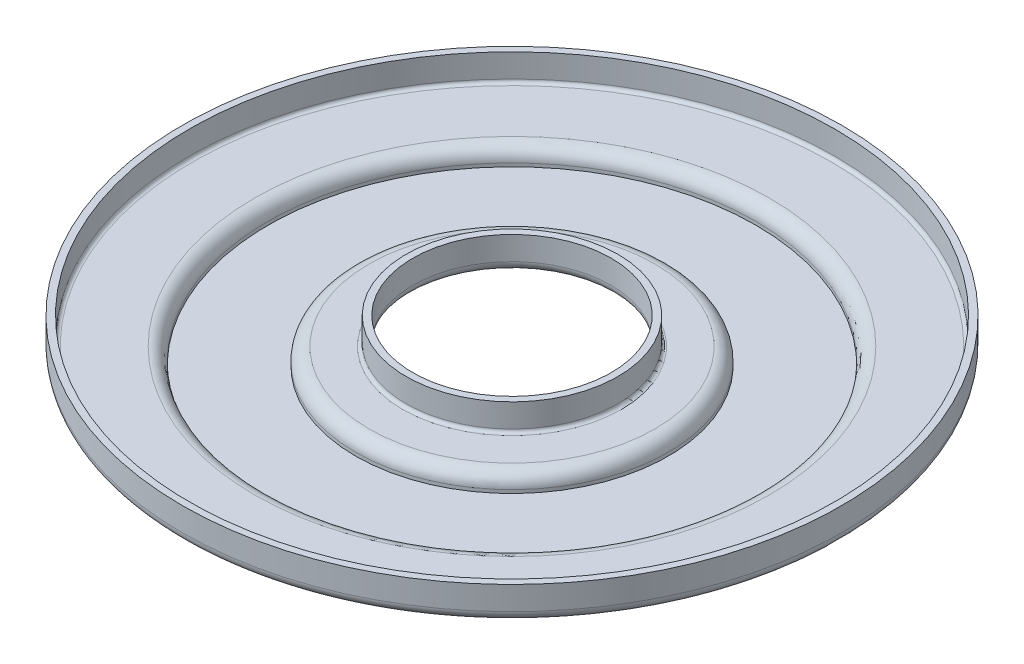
ISO-10303-21;
HEADER;
FILE_DESCRIPTION(('STEP AP214'),'2;1');
FILE_NAME('part.step','',(''),(''),'','','');
FILE_SCHEMA(('AUTOMOTIVE_DESIGN { 1 0 10303 214 1 1 1 1 }'));
ENDSEC;
DATA;
#1=APPLICATION_CONTEXT('core data for automotive mechanical design processes');
#2=APPLICATION_PROTOCOL_DEFINITION('international standard','automotive_design',2000,#1);
#3=PRODUCT_CONTEXT('',#1,'mechanical');
#4=PRODUCT('Part','Part','',(#3));
#5=PRODUCT_RELATED_PRODUCT_CATEGORY('part','',(#4));
#6=PRODUCT_DEFINITION_FORMATION('','',#4);
#7=PRODUCT_DEFINITION_CONTEXT('part definition',#1,'design');
#8=PRODUCT_DEFINITION('design','',#6,#7);
#9=PRODUCT_DEFINITION_SHAPE('','',#8);
#10=(LENGTH_UNIT() NAMED_UNIT(*) SI_UNIT(.MILLI.,.METRE.));
#11=(NAMED_UNIT(*) PLANE_ANGLE_UNIT() SI_UNIT($,.RADIAN.));
#12=(NAMED_UNIT(*) SI_UNIT($,.STERADIAN.) SOLID_ANGLE_UNIT());
#13=UNCERTAINTY_MEASURE_WITH_UNIT(LENGTH_MEASURE(1.E-05),#10,'distance_accuracy_value','');
#14=(GEOMETRIC_REPRESENTATION_CONTEXT(3) GLOBAL_UNCERTAINTY_ASSIGNED_CONTEXT((#13)) GLOBAL_UNIT_ASSIGNED_CONTEXT((#10,
#11,#12)) REPRESENTATION_CONTEXT('',''));
#15=CARTESIAN_POINT('',(0.,0.,0.));
#16=DIRECTION('',(0.,0.,1.));
#17=DIRECTION('',(1.,0.,0.));
#18=AXIS2_PLACEMENT_3D('',#15,#16,#17);
#19=CARTESIAN_POINT('',(0.,0.,0.));
#20=DIRECTION('',(0.,-1.,0.));
#21=DIRECTION('',(0.,0.,-1.));
#22=AXIS2_PLACEMENT_3D('',#19,#20,#21);
#23=CYLINDRICAL_SURFACE('',#22,98.);
#24=CARTESIAN_POINT('',(0.,15.,0.));
#25=DIRECTION('',(0.,-1.,0.));
#26=DIRECTION('',(0.,0.,-1.));
#27=AXIS2_PLACEMENT_3D('',#24,#25,#26);
#28=CIRCLE('',#27,98.);
#29=CARTESIAN_POINT('',(0.,15.,-98.));
#30=VERTEX_POINT('',#29);
#31=EDGE_CURVE('E10',#30,#30,#28,.T.);
#32=ORIENTED_EDGE('',*,*,#31,.T.);
#33=EDGE_LOOP('',(#32));
#34=FACE_BOUND('',#33,.T.);
#35=CARTESIAN_POINT('',(0.,8.00000000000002,0.));
#36=DIRECTION('',(0.,-1.,0.));
#37=DIRECTION('',(0.,0.,-1.));
#38=AXIS2_PLACEMENT_3D('',#35,#36,#37);
#39=CIRCLE('',#38,98.);
#40=CARTESIAN_POINT('',(0.,8.00000000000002,-98.));
#41=VERTEX_POINT('',#40);
#42=EDGE_CURVE('E117',#41,#41,#39,.T.);
#43=ORIENTED_EDGE('',*,*,#42,.F.);
#44=EDGE_LOOP('',(#43));
#45=FACE_BOUND('',#44,.T.);
#46=ADVANCED_FACE('F35',(#34,#45),#23,.T.);
#47=CARTESIAN_POINT('',(96.,15.,0.));
#48=DIRECTION('',(0.,-1.,0.));
#49=DIRECTION('',(0.,0.,-1.));
#50=AXIS2_PLACEMENT_3D('',#47,#48,#49);
#51=PLANE('',#50);
#52=ORIENTED_EDGE('',*,*,#31,.F.);
#53=EDGE_LOOP('',(#52));
#54=FACE_BOUND('',#53,.T.);
#55=CARTESIAN_POINT('',(0.,15.,0.));
#56=DIRECTION('',(0.,-1.,0.));
#57=DIRECTION('',(0.,0.,-1.));
#58=AXIS2_PLACEMENT_3D('',#55,#56,#57);
#59=CIRCLE('',#58,96.);
#60=CARTESIAN_POINT('',(0.,15.,-96.));
#61=VERTEX_POINT('',#60);
#62=EDGE_CURVE('E41',#61,#61,#59,.T.);
#63=ORIENTED_EDGE('',*,*,#62,.T.);
#64=EDGE_LOOP('',(#63));
#65=FACE_BOUND('',#64,.T.);
#66=ADVANCED_FACE('F125',(#54,#65),#51,.F.);
#67=CARTESIAN_POINT('',(0.,0.,0.));
#68=DIRECTION('',(0.,-1.,0.));
#69=DIRECTION('',(0.,0.,-1.));
#70=AXIS2_PLACEMENT_3D('',#67,#68,#69);
#71=CYLINDRICAL_SURFACE('',#70,96.);
#72=ORIENTED_EDGE('',*,*,#62,.F.);
#73=EDGE_LOOP('',(#72));
#74=FACE_BOUND('',#73,.T.);
#75=CARTESIAN_POINT('',(0.,8.00000000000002,0.));
#76=DIRECTION('',(0.,-1.,0.));
#77=DIRECTION('',(0.,0.,-1.));
#78=AXIS2_PLACEMENT_3D('',#75,#76,#77);
#79=CIRCLE('',#78,96.);
#80=CARTESIAN_POINT('',(0.,8.00000000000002,-96.));
#81=VERTEX_POINT('',#80);
#82=EDGE_CURVE('E45',#81,#81,#79,.T.);
#83=ORIENTED_EDGE('',*,*,#82,.T.);
#84=EDGE_LOOP('',(#83));
#85=FACE_BOUND('',#84,.T.);
#86=ADVANCED_FACE('F129',(#74,#85),#71,.F.);
#87=CARTESIAN_POINT('',(0.,8.,0.));
#88=DIRECTION('',(0.,-1.,0.));
#89=DIRECTION('',(0.,0.,-1.));
#90=AXIS2_PLACEMENT_3D('',#87,#88,#89);
#91=TOROIDAL_SURFACE('',#90,95.,1.);
#92=ORIENTED_EDGE('',*,*,#82,.F.);
#93=EDGE_LOOP('',(#92));
#94=FACE_BOUND('',#93,.T.);
#95=CARTESIAN_POINT('',(0.,7.,0.));
#96=DIRECTION('',(0.,-1.,0.));
#97=DIRECTION('',(0.,0.,-1.));
#98=AXIS2_PLACEMENT_3D('',#95,#96,#97);
#99=CIRCLE('',#98,95.);
#100=CARTESIAN_POINT('',(0.,7.,-95.));
#101=VERTEX_POINT('',#100);
#102=EDGE_CURVE('E49',#101,#101,#99,.T.);
#103=ORIENTED_EDGE('',*,*,#102,.T.);
#104=EDGE_LOOP('',(#103));
#105=FACE_BOUND('',#104,.T.);
#106=ADVANCED_FACE('F134',(#94,#105),#91,.F.);
#107=CARTESIAN_POINT('',(95.,7.,0.));
#108=DIRECTION('',(0.,-1.,0.));
#109=DIRECTION('',(0.,0.,-1.));
#110=AXIS2_PLACEMENT_3D('',#107,#108,#109);
#111=PLANE('',#110);
#112=ORIENTED_EDGE('',*,*,#102,.F.);
#113=EDGE_LOOP('',(#112));
#114=FACE_BOUND('',#113,.T.);
#115=CARTESIAN_POINT('',(0.,7.,0.));
#116=DIRECTION('',(0.,-1.,0.));
#117=DIRECTION('',(0.,0.,-1.));
#118=AXIS2_PLACEMENT_3D('',#115,#116,#117);
#119=CIRCLE('',#118,76.5);
#120=CARTESIAN_POINT('',(0.,7.,-76.5));
#121=VERTEX_POINT('',#120);
#122=EDGE_CURVE('E54',#121,#121,#119,.T.);
#123=ORIENTED_EDGE('',*,*,#122,.T.);
#124=EDGE_LOOP('',(#123));
#125=FACE_BOUND('',#124,.T.);
#126=ADVANCED_FACE('F140',(#114,#125),#111,.F.);
#127=CARTESIAN_POINT('',(0.,3.,0.));
#128=DIRECTION('',(0.,-1.,0.));
#129=DIRECTION('',(0.,0.,-1.));
#130=AXIS2_PLACEMENT_3D('',#127,#128,#129);
#131=TOROIDAL_SURFACE('',#130,76.5,4.);
#132=ORIENTED_EDGE('',*,*,#122,.F.);
#133=EDGE_LOOP('',(#132));
#134=FACE_BOUND('',#133,.T.);
#135=CARTESIAN_POINT('',(0.,2.99999999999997,0.));
#136=DIRECTION('',(0.,-1.,0.));
#137=DIRECTION('',(0.,0.,-1.));
#138=AXIS2_PLACEMENT_3D('',#135,#136,#137);
#139=CIRCLE('',#138,72.5);
#140=CARTESIAN_POINT('',(0.,2.99999999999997,-72.5));
#141=VERTEX_POINT('',#140);
#142=EDGE_CURVE('E57',#141,#141,#139,.T.);
#143=ORIENTED_EDGE('',*,*,#142,.T.);
#144=EDGE_LOOP('',(#143));
#145=FACE_BOUND('',#144,.T.);
#146=ADVANCED_FACE('F144',(#134,#145),#131,.T.);
#147=CARTESIAN_POINT('',(0.,0.,0.));
#148=DIRECTION('',(0.,-1.,0.));
#149=DIRECTION('',(0.,0.,-1.));
#150=AXIS2_PLACEMENT_3D('',#147,#148,#149);
#151=CYLINDRICAL_SURFACE('',#150,72.5);
#152=ORIENTED_EDGE('',*,*,#142,.F.);
#153=EDGE_LOOP('',(#152));
#154=FACE_BOUND('',#153,.T.);
#155=CARTESIAN_POINT('',(0.,2.,0.));
#156=DIRECTION('',(0.,-1.,0.));
#157=DIRECTION('',(0.,0.,-1.));
#158=AXIS2_PLACEMENT_3D('',#155,#156,#157);
#159=CIRCLE('',#158,72.5);
#160=CARTESIAN_POINT('',(0.,2.,-72.5));
#161=VERTEX_POINT('',#160);
#162=EDGE_CURVE('E60',#161,#161,#159,.T.);
#163=ORIENTED_EDGE('',*,*,#162,.T.);
#164=EDGE_LOOP('',(#163));
#165=FACE_BOUND('',#164,.T.);
#166=ADVANCED_FACE('F148',(#154,#165),#151,.F.);
#167=CARTESIAN_POINT('',(46.5,2.,0.));
#168=DIRECTION('',(0.,-1.,0.));
#169=DIRECTION('',(0.,0.,-1.));
#170=AXIS2_PLACEMENT_3D('',#167,#168,#169);
#171=PLANE('',#170);
#172=ORIENTED_EDGE('',*,*,#162,.F.);
#173=EDGE_LOOP('',(#172));
#174=FACE_BOUND('',#173,.T.);
#175=CARTESIAN_POINT('',(0.,2.,0.));
#176=DIRECTION('',(0.,-1.,0.));
#177=DIRECTION('',(0.,0.,-1.));
#178=AXIS2_PLACEMENT_3D('',#175,#176,#177);
#179=CIRCLE('',#178,46.5);
#180=CARTESIAN_POINT('',(0.,2.,-46.5));
#181=VERTEX_POINT('',#180);
#182=EDGE_CURVE('E63',#181,#181,#179,.T.);
#183=ORIENTED_EDGE('',*,*,#182,.T.);
#184=EDGE_LOOP('',(#183));
#185=FACE_BOUND('',#184,.T.);
#186=ADVANCED_FACE('F152',(#174,#185),#171,.F.);
#187=CARTESIAN_POINT('',(0.,0.,0.));
#188=DIRECTION('',(0.,-1.,0.));
#189=DIRECTION('',(0.,0.,-1.));
#190=AXIS2_PLACEMENT_3D('',#187,#188,#189);
#191=CYLINDRICAL_SURFACE('',#190,46.5);
#192=ORIENTED_EDGE('',*,*,#182,.F.);
#193=EDGE_LOOP('',(#192));
#194=FACE_BOUND('',#193,.T.);
#195=CARTESIAN_POINT('',(0.,2.99999999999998,0.));
#196=DIRECTION('',(0.,-1.,0.));
#197=DIRECTION('',(0.,0.,-1.));
#198=AXIS2_PLACEMENT_3D('',#195,#196,#197);
#199=CIRCLE('',#198,46.5);
#200=CARTESIAN_POINT('',(0.,2.99999999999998,-46.5));
#201=VERTEX_POINT('',#200);
#202=EDGE_CURVE('E66',#201,#201,#199,.T.);
#203=ORIENTED_EDGE('',*,*,#202,.T.);
#204=EDGE_LOOP('',(#203));
#205=FACE_BOUND('',#204,.T.);
#206=ADVANCED_FACE('F156',(#194,#205),#191,.T.);
#207=CARTESIAN_POINT('',(0.,2.99999999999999,0.));
#208=DIRECTION('',(0.,-1.,0.));
#209=DIRECTION('',(0.,0.,-1.));
#210=AXIS2_PLACEMENT_3D('',#207,#208,#209);
#211=TOROIDAL_SURFACE('',#210,42.5,4.);
#212=ORIENTED_EDGE('',*,*,#202,.F.);
#213=EDGE_LOOP('',(#212));
#214=FACE_BOUND('',#213,.T.);
#215=CARTESIAN_POINT('',(0.,6.99999999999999,0.));
#216=DIRECTION('',(0.,-1.,0.));
#217=DIRECTION('',(0.,0.,-1.));
#218=AXIS2_PLACEMENT_3D('',#215,#216,#217);
#219=CIRCLE('',#218,42.5);
#220=CARTESIAN_POINT('',(0.,6.99999999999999,-42.5));
#221=VERTEX_POINT('',#220);
#222=EDGE_CURVE('E69',#221,#221,#219,.T.);
#223=ORIENTED_EDGE('',*,*,#222,.T.);
#224=EDGE_LOOP('',(#223));
#225=FACE_BOUND('',#224,.T.);
#226=ADVANCED_FACE('F160',(#214,#225),#211,.T.);
#227=CARTESIAN_POINT('',(42.5,6.99999999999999,0.));
#228=DIRECTION('',(0.,-1.,0.));
#229=DIRECTION('',(0.,0.,-1.));
#230=AXIS2_PLACEMENT_3D('',#227,#228,#229);
#231=PLANE('',#230);
#232=ORIENTED_EDGE('',*,*,#222,.F.);
#233=EDGE_LOOP('',(#232));
#234=FACE_BOUND('',#233,.T.);
#235=CARTESIAN_POINT('',(0.,6.99999999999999,0.));
#236=DIRECTION('',(0.,-1.,0.));
#237=DIRECTION('',(0.,0.,-1.));
#238=AXIS2_PLACEMENT_3D('',#235,#236,#237);
#239=CIRCLE('',#238,32.5);
#240=CARTESIAN_POINT('',(0.,6.99999999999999,-32.5));
#241=VERTEX_POINT('',#240);
#242=EDGE_CURVE('E72',#241,#241,#239,.T.);
#243=ORIENTED_EDGE('',*,*,#242,.T.);
#244=EDGE_LOOP('',(#243));
#245=FACE_BOUND('',#244,.T.);
#246=ADVANCED_FACE('F164',(#234,#245),#231,.F.);
#247=CARTESIAN_POINT('',(0.,7.99999999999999,0.));
#248=DIRECTION('',(0.,-1.,0.));
#249=DIRECTION('',(0.,0.,-1.));
#250=AXIS2_PLACEMENT_3D('',#247,#248,#249);
#251=TOROIDAL_SURFACE('',#250,32.5,0.999999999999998);
#252=ORIENTED_EDGE('',*,*,#242,.F.);
#253=EDGE_LOOP('',(#252));
#254=FACE_BOUND('',#253,.T.);
#255=CARTESIAN_POINT('',(0.,8.,0.));
#256=DIRECTION('',(0.,-1.,0.));
#257=DIRECTION('',(0.,0.,-1.));
#258=AXIS2_PLACEMENT_3D('',#255,#256,#257);
#259=CIRCLE('',#258,31.5);
#260=CARTESIAN_POINT('',(0.,8.,-31.5));
#261=VERTEX_POINT('',#260);
#262=EDGE_CURVE('E75',#261,#261,#259,.T.);
#263=ORIENTED_EDGE('',*,*,#262,.T.);
#264=EDGE_LOOP('',(#263));
#265=FACE_BOUND('',#264,.T.);
#266=ADVANCED_FACE('F168',(#254,#265),#251,.F.);
#267=CARTESIAN_POINT('',(0.,0.,0.));
#268=DIRECTION('',(0.,-1.,0.));
#269=DIRECTION('',(0.,0.,-1.));
#270=AXIS2_PLACEMENT_3D('',#267,#268,#269);
#271=CYLINDRICAL_SURFACE('',#270,31.5);
#272=ORIENTED_EDGE('',*,*,#262,.F.);
#273=EDGE_LOOP('',(#272));
#274=FACE_BOUND('',#273,.T.);
#275=CARTESIAN_POINT('',(0.,15.,0.));
#276=DIRECTION('',(0.,-1.,0.));
#277=DIRECTION('',(0.,0.,-1.));
#278=AXIS2_PLACEMENT_3D('',#275,#276,#277);
#279=CIRCLE('',#278,31.5);
#280=CARTESIAN_POINT('',(0.,15.,-31.5));
#281=VERTEX_POINT('',#280);
#282=EDGE_CURVE('E78',#281,#281,#279,.T.);
#283=ORIENTED_EDGE('',*,*,#282,.T.);
#284=EDGE_LOOP('',(#283));
#285=FACE_BOUND('',#284,.T.);
#286=ADVANCED_FACE('F172',(#274,#285),#271,.T.);
#287=CARTESIAN_POINT('',(29.5,15.,0.));
#288=DIRECTION('',(0.,-1.,0.));
#289=DIRECTION('',(0.,0.,-1.));
#290=AXIS2_PLACEMENT_3D('',#287,#288,#289);
#291=PLANE('',#290);
#292=ORIENTED_EDGE('',*,*,#282,.F.);
#293=EDGE_LOOP('',(#292));
#294=FACE_BOUND('',#293,.T.);
#295=CARTESIAN_POINT('',(0.,15.,0.));
#296=DIRECTION('',(0.,-1.,0.));
#297=DIRECTION('',(0.,0.,-1.));
#298=AXIS2_PLACEMENT_3D('',#295,#296,#297);
#299=CIRCLE('',#298,29.5);
#300=CARTESIAN_POINT('',(0.,15.,-29.5));
#301=VERTEX_POINT('',#300);
#302=EDGE_CURVE('E81',#301,#301,#299,.T.);
#303=ORIENTED_EDGE('',*,*,#302,.T.);
#304=EDGE_LOOP('',(#303));
#305=FACE_BOUND('',#304,.T.);
#306=ADVANCED_FACE('F176',(#294,#305),#291,.F.);
#307=CARTESIAN_POINT('',(0.,0.,0.));
#308=DIRECTION('',(0.,-1.,0.));
#309=DIRECTION('',(0.,0.,-1.));
#310=AXIS2_PLACEMENT_3D('',#307,#308,#309);
#311=CYLINDRICAL_SURFACE('',#310,29.5);
#312=CARTESIAN_POINT('',(0.,8.00000000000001,0.));
#313=DIRECTION('',(0.,-1.,0.));
#314=DIRECTION('',(0.,0.,-1.));
#315=AXIS2_PLACEMENT_3D('',#312,#313,#314);
#316=CIRCLE('',#315,29.5);
#317=CARTESIAN_POINT('',(0.,8.00000000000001,-29.5));
#318=VERTEX_POINT('',#317);
#319=EDGE_CURVE('E84',#318,#318,#316,.T.);
#320=ORIENTED_EDGE('',*,*,#319,.T.);
#321=EDGE_LOOP('',(#320));
#322=FACE_BOUND('',#321,.T.);
#323=ORIENTED_EDGE('',*,*,#302,.F.);
#324=EDGE_LOOP('',(#323));
#325=FACE_BOUND('',#324,.T.);
#326=ADVANCED_FACE('F180',(#322,#325),#311,.F.);
#327=CARTESIAN_POINT('',(0.,7.99999999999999,0.));
#328=DIRECTION('',(0.,-1.,0.));
#329=DIRECTION('',(0.,0.,-1.));
#330=AXIS2_PLACEMENT_3D('',#327,#328,#329);
#331=TOROIDAL_SURFACE('',#330,32.5,3.);
#332=CARTESIAN_POINT('',(0.,4.99999999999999,0.));
#333=DIRECTION('',(0.,-1.,0.));
#334=DIRECTION('',(0.,0.,-1.));
#335=AXIS2_PLACEMENT_3D('',#332,#333,#334);
#336=CIRCLE('',#335,32.5);
#337=CARTESIAN_POINT('',(0.,4.99999999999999,-32.5));
#338=VERTEX_POINT('',#337);
#339=EDGE_CURVE('E87',#338,#338,#336,.T.);
#340=ORIENTED_EDGE('',*,*,#339,.T.);
#341=EDGE_LOOP('',(#340));
#342=FACE_BOUND('',#341,.T.);
#343=ORIENTED_EDGE('',*,*,#319,.F.);
#344=EDGE_LOOP('',(#343));
#345=FACE_BOUND('',#344,.T.);
#346=ADVANCED_FACE('F184',(#342,#345),#331,.T.);
#347=CARTESIAN_POINT('',(42.5,4.99999999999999,0.));
#348=DIRECTION('',(0.,-1.,0.));
#349=DIRECTION('',(0.,0.,-1.));
#350=AXIS2_PLACEMENT_3D('',#347,#348,#349);
#351=PLANE('',#350);
#352=CARTESIAN_POINT('',(0.,4.99999999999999,0.));
#353=DIRECTION('',(0.,-1.,0.));
#354=DIRECTION('',(0.,0.,-1.));
#355=AXIS2_PLACEMENT_3D('',#352,#353,#354);
#356=CIRCLE('',#355,42.5);
#357=CARTESIAN_POINT('',(0.,4.99999999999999,-42.5));
#358=VERTEX_POINT('',#357);
#359=EDGE_CURVE('E90',#358,#358,#356,.T.);
#360=ORIENTED_EDGE('',*,*,#359,.T.);
#361=EDGE_LOOP('',(#360));
#362=FACE_BOUND('',#361,.T.);
#363=ORIENTED_EDGE('',*,*,#339,.F.);
#364=EDGE_LOOP('',(#363));
#365=FACE_BOUND('',#364,.T.);
#366=ADVANCED_FACE('F188',(#362,#365),#351,.T.);
#367=CARTESIAN_POINT('',(0.,2.99999999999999,0.));
#368=DIRECTION('',(0.,-1.,0.));
#369=DIRECTION('',(0.,0.,-1.));
#370=AXIS2_PLACEMENT_3D('',#367,#368,#369);
#371=TOROIDAL_SURFACE('',#370,42.5,2.);
#372=CARTESIAN_POINT('',(0.,2.99999999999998,0.));
#373=DIRECTION('',(0.,-1.,0.));
#374=DIRECTION('',(0.,0.,-1.));
#375=AXIS2_PLACEMENT_3D('',#372,#373,#374);
#376=CIRCLE('',#375,44.5);
#377=CARTESIAN_POINT('',(0.,2.99999999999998,-44.5));
#378=VERTEX_POINT('',#377);
#379=EDGE_CURVE('E93',#378,#378,#376,.T.);
#380=ORIENTED_EDGE('',*,*,#379,.T.);
#381=EDGE_LOOP('',(#380));
#382=FACE_BOUND('',#381,.T.);
#383=ORIENTED_EDGE('',*,*,#359,.F.);
#384=EDGE_LOOP('',(#383));
#385=FACE_BOUND('',#384,.T.);
#386=ADVANCED_FACE('F192',(#382,#385),#371,.F.);
#387=CARTESIAN_POINT('',(0.,0.,0.));
#388=DIRECTION('',(0.,-1.,0.));
#389=DIRECTION('',(0.,0.,-1.));
#390=AXIS2_PLACEMENT_3D('',#387,#388,#389);
#391=CYLINDRICAL_SURFACE('',#390,44.5);
#392=CARTESIAN_POINT('',(0.,2.00000000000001,0.));
#393=DIRECTION('',(0.,-1.,0.));
#394=DIRECTION('',(0.,0.,-1.));
#395=AXIS2_PLACEMENT_3D('',#392,#393,#394);
#396=CIRCLE('',#395,44.5);
#397=CARTESIAN_POINT('',(0.,2.00000000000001,-44.5));
#398=VERTEX_POINT('',#397);
#399=EDGE_CURVE('E96',#398,#398,#396,.T.);
#400=ORIENTED_EDGE('',*,*,#399,.T.);
#401=EDGE_LOOP('',(#400));
#402=FACE_BOUND('',#401,.T.);
#403=ORIENTED_EDGE('',*,*,#379,.F.);
#404=EDGE_LOOP('',(#403));
#405=FACE_BOUND('',#404,.T.);
#406=ADVANCED_FACE('F196',(#402,#405),#391,.F.);
#407=CARTESIAN_POINT('',(0.,2.,0.));
#408=DIRECTION('',(0.,-1.,0.));
#409=DIRECTION('',(0.,0.,-1.));
#410=AXIS2_PLACEMENT_3D('',#407,#408,#409);
#411=TOROIDAL_SURFACE('',#410,46.5,2.);
#412=CARTESIAN_POINT('',(0.,0.,0.));
#413=DIRECTION('',(0.,-1.,0.));
#414=DIRECTION('',(0.,0.,-1.));
#415=AXIS2_PLACEMENT_3D('',#412,#413,#414);
#416=CIRCLE('',#415,46.5);
#417=CARTESIAN_POINT('',(0.,0.,-46.5));
#418=VERTEX_POINT('',#417);
#419=EDGE_CURVE('E99',#418,#418,#416,.T.);
#420=ORIENTED_EDGE('',*,*,#419,.T.);
#421=EDGE_LOOP('',(#420));
#422=FACE_BOUND('',#421,.T.);
#423=ORIENTED_EDGE('',*,*,#399,.F.);
#424=EDGE_LOOP('',(#423));
#425=FACE_BOUND('',#424,.T.);
#426=ADVANCED_FACE('F200',(#422,#425),#411,.T.);
#427=CARTESIAN_POINT('',(46.5,0.,0.));
#428=DIRECTION('',(0.,-1.,0.));
#429=DIRECTION('',(0.,0.,-1.));
#430=AXIS2_PLACEMENT_3D('',#427,#428,#429);
#431=PLANE('',#430);
#432=CARTESIAN_POINT('',(0.,0.,0.));
#433=DIRECTION('',(0.,-1.,0.));
#434=DIRECTION('',(0.,0.,-1.));
#435=AXIS2_PLACEMENT_3D('',#432,#433,#434);
#436=CIRCLE('',#435,72.5);
#437=CARTESIAN_POINT('',(0.,0.,-72.5));
#438=VERTEX_POINT('',#437);
#439=EDGE_CURVE('E102',#438,#438,#436,.T.);
#440=ORIENTED_EDGE('',*,*,#439,.T.);
#441=EDGE_LOOP('',(#440));
#442=FACE_BOUND('',#441,.T.);
#443=ORIENTED_EDGE('',*,*,#419,.F.);
#444=EDGE_LOOP('',(#443));
#445=FACE_BOUND('',#444,.T.);
#446=ADVANCED_FACE('F204',(#442,#445),#431,.T.);
#447=CARTESIAN_POINT('',(0.,2.,0.));
#448=DIRECTION('',(0.,-1.,0.));
#449=DIRECTION('',(0.,0.,-1.));
#450=AXIS2_PLACEMENT_3D('',#447,#448,#449);
#451=TOROIDAL_SURFACE('',#450,72.5,2.);
#452=CARTESIAN_POINT('',(0.,2.00000000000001,0.));
#453=DIRECTION('',(0.,-1.,0.));
#454=DIRECTION('',(0.,0.,-1.));
#455=AXIS2_PLACEMENT_3D('',#452,#453,#454);
#456=CIRCLE('',#455,74.5);
#457=CARTESIAN_POINT('',(0.,2.00000000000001,-74.5));
#458=VERTEX_POINT('',#457);
#459=EDGE_CURVE('E105',#458,#458,#456,.T.);
#460=ORIENTED_EDGE('',*,*,#459,.T.);
#461=EDGE_LOOP('',(#460));
#462=FACE_BOUND('',#461,.T.);
#463=ORIENTED_EDGE('',*,*,#439,.F.);
#464=EDGE_LOOP('',(#463));
#465=FACE_BOUND('',#464,.T.);
#466=ADVANCED_FACE('F208',(#462,#465),#451,.T.);
#467=CARTESIAN_POINT('',(0.,0.,0.));
#468=DIRECTION('',(0.,-1.,0.));
#469=DIRECTION('',(0.,0.,-1.));
#470=AXIS2_PLACEMENT_3D('',#467,#468,#469);
#471=CYLINDRICAL_SURFACE('',#470,74.5);
#472=CARTESIAN_POINT('',(0.,2.99999999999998,0.));
#473=DIRECTION('',(0.,-1.,0.));
#474=DIRECTION('',(0.,0.,-1.));
#475=AXIS2_PLACEMENT_3D('',#472,#473,#474);
#476=CIRCLE('',#475,74.5);
#477=CARTESIAN_POINT('',(0.,2.99999999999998,-74.5));
#478=VERTEX_POINT('',#477);
#479=EDGE_CURVE('E108',#478,#478,#476,.T.);
#480=ORIENTED_EDGE('',*,*,#479,.T.);
#481=EDGE_LOOP('',(#480));
#482=FACE_BOUND('',#481,.T.);
#483=ORIENTED_EDGE('',*,*,#459,.F.);
#484=EDGE_LOOP('',(#483));
#485=FACE_BOUND('',#484,.T.);
#486=ADVANCED_FACE('F212',(#482,#485),#471,.T.);
#487=CARTESIAN_POINT('',(0.,3.,0.));
#488=DIRECTION('',(0.,-1.,0.));
#489=DIRECTION('',(0.,0.,-1.));
#490=AXIS2_PLACEMENT_3D('',#487,#488,#489);
#491=TOROIDAL_SURFACE('',#490,76.5,2.);
#492=CARTESIAN_POINT('',(0.,5.,0.));
#493=DIRECTION('',(0.,-1.,0.));
#494=DIRECTION('',(0.,0.,-1.));
#495=AXIS2_PLACEMENT_3D('',#492,#493,#494);
#496=CIRCLE('',#495,76.5);
#497=CARTESIAN_POINT('',(0.,5.,-76.5));
#498=VERTEX_POINT('',#497);
#499=EDGE_CURVE('E111',#498,#498,#496,.T.);
#500=ORIENTED_EDGE('',*,*,#499,.T.);
#501=EDGE_LOOP('',(#500));
#502=FACE_BOUND('',#501,.T.);
#503=ORIENTED_EDGE('',*,*,#479,.F.);
#504=EDGE_LOOP('',(#503));
#505=FACE_BOUND('',#504,.T.);
#506=ADVANCED_FACE('F216',(#502,#505),#491,.F.);
#507=CARTESIAN_POINT('',(95.,5.,0.));
#508=DIRECTION('',(0.,-1.,0.));
#509=DIRECTION('',(0.,0.,-1.));
#510=AXIS2_PLACEMENT_3D('',#507,#508,#509);
#511=PLANE('',#510);
#512=CARTESIAN_POINT('',(0.,5.,0.));
#513=DIRECTION('',(0.,-1.,0.));
#514=DIRECTION('',(0.,0.,-1.));
#515=AXIS2_PLACEMENT_3D('',#512,#513,#514);
#516=CIRCLE('',#515,95.);
#517=CARTESIAN_POINT('',(0.,5.,-95.));
#518=VERTEX_POINT('',#517);
#519=EDGE_CURVE('E114',#518,#518,#516,.T.);
#520=ORIENTED_EDGE('',*,*,#519,.T.);
#521=EDGE_LOOP('',(#520));
#522=FACE_BOUND('',#521,.T.);
#523=ORIENTED_EDGE('',*,*,#499,.F.);
#524=EDGE_LOOP('',(#523));
#525=FACE_BOUND('',#524,.T.);
#526=ADVANCED_FACE('F220',(#522,#525),#511,.T.);
#527=CARTESIAN_POINT('',(0.,8.,0.));
#528=DIRECTION('',(0.,-1.,0.));
#529=DIRECTION('',(0.,0.,-1.));
#530=AXIS2_PLACEMENT_3D('',#527,#528,#529);
#531=TOROIDAL_SURFACE('',#530,95.,3.);
#532=ORIENTED_EDGE('',*,*,#42,.T.);
#533=EDGE_LOOP('',(#532));
#534=FACE_BOUND('',#533,.T.);
#535=ORIENTED_EDGE('',*,*,#519,.F.);
#536=EDGE_LOOP('',(#535));
#537=FACE_BOUND('',#536,.T.);
#538=ADVANCED_FACE('F121',(#534,#537),#531,.T.);
#539=CLOSED_SHELL('',(#46,#66,#86,#106,#126,#146,#166,#186,#206,#226,#246,#266,#286,#306,#326,
#346,#366,#386,#406,#426,#446,#466,#486,#506,#526,#538));
#540=MANIFOLD_SOLID_BREP('B2',#539);
#541=ADVANCED_BREP_SHAPE_REPRESENTATION('',(#18,#540),#14);
#542=SHAPE_DEFINITION_REPRESENTATION(#9,#541);
ENDSEC;
END-ISO-10303-21;
